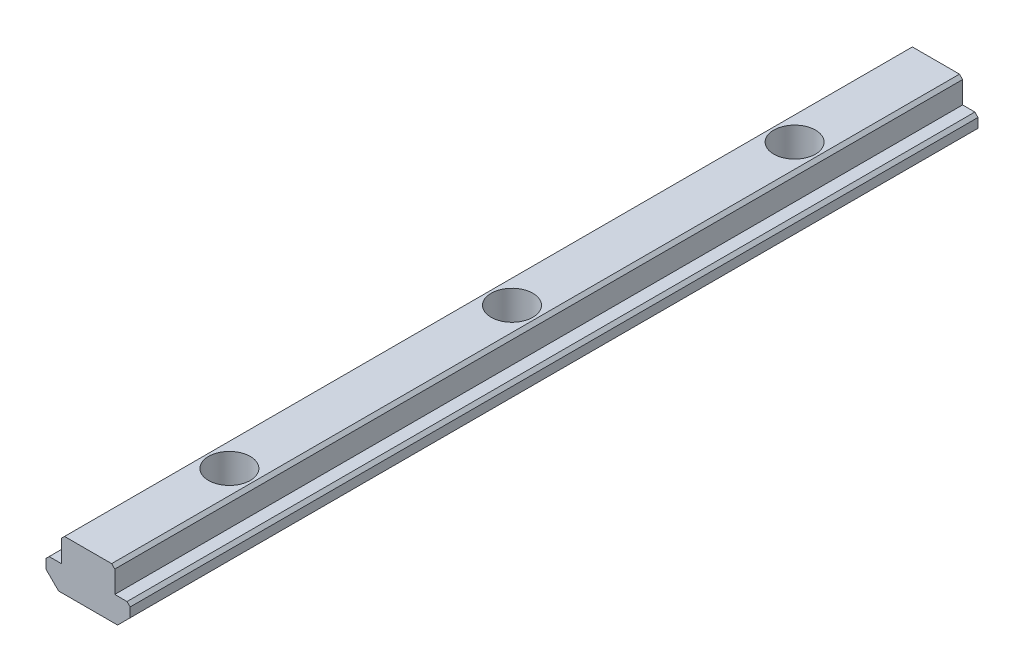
ISO-10303-21;
HEADER;
FILE_DESCRIPTION(('STEP AP214'),'2;1');
FILE_NAME('part.step','',(''),(''),'','','');
FILE_SCHEMA(('AUTOMOTIVE_DESIGN { 1 0 10303 214 1 1 1 1 }'));
ENDSEC;
DATA;
#1=APPLICATION_CONTEXT('core data for automotive mechanical design processes');
#2=APPLICATION_PROTOCOL_DEFINITION('international standard','automotive_design',2000,#1);
#3=PRODUCT_CONTEXT('',#1,'mechanical');
#4=PRODUCT('Part','Part','',(#3));
#5=PRODUCT_RELATED_PRODUCT_CATEGORY('part','',(#4));
#6=PRODUCT_DEFINITION_FORMATION('','',#4);
#7=PRODUCT_DEFINITION_CONTEXT('part definition',#1,'design');
#8=PRODUCT_DEFINITION('design','',#6,#7);
#9=PRODUCT_DEFINITION_SHAPE('','',#8);
#10=(LENGTH_UNIT() NAMED_UNIT(*) SI_UNIT(.MILLI.,.METRE.));
#11=(NAMED_UNIT(*) PLANE_ANGLE_UNIT() SI_UNIT($,.RADIAN.));
#12=(NAMED_UNIT(*) SI_UNIT($,.STERADIAN.) SOLID_ANGLE_UNIT());
#13=UNCERTAINTY_MEASURE_WITH_UNIT(LENGTH_MEASURE(1.E-05),#10,'distance_accuracy_value','');
#14=(GEOMETRIC_REPRESENTATION_CONTEXT(3) GLOBAL_UNCERTAINTY_ASSIGNED_CONTEXT((#13)) GLOBAL_UNIT_ASSIGNED_CONTEXT((#10,
#11,#12)) REPRESENTATION_CONTEXT('',''));
#15=CARTESIAN_POINT('',(0.,0.,0.));
#16=DIRECTION('',(0.,0.,1.));
#17=DIRECTION('',(1.,0.,0.));
#18=AXIS2_PLACEMENT_3D('',#15,#16,#17);
#19=CARTESIAN_POINT('',(-6.7,-0.499999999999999,0.));
#20=DIRECTION('',(-0.707106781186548,0.707106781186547,0.));
#21=DIRECTION('',(-0.707106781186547,-0.707106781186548,0.));
#22=AXIS2_PLACEMENT_3D('',#19,#20,#21);
#23=PLANE('',#22);
#24=DIRECTION('',(-0.707106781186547,-0.707106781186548,0.));
#25=VECTOR('',#24,1.);
#26=CARTESIAN_POINT('',(-6.7,-0.499999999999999,0.));
#27=LINE('',#26,#25);
#28=CARTESIAN_POINT('',(-6.2,0.,0.));
#29=VERTEX_POINT('',#28);
#30=CARTESIAN_POINT('',(-6.7,-0.499999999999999,0.));
#31=VERTEX_POINT('',#30);
#32=EDGE_CURVE('E178',#29,#31,#27,.T.);
#33=ORIENTED_EDGE('',*,*,#32,.T.);
#34=DIRECTION('',(0.,0.,1.));
#35=VECTOR('',#34,1.);
#36=CARTESIAN_POINT('',(-6.7,-0.499999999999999,0.));
#37=LINE('',#36,#35);
#38=CARTESIAN_POINT('',(-6.7,-0.499999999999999,135.));
#39=VERTEX_POINT('',#38);
#40=EDGE_CURVE('E167',#39,#31,#37,.F.);
#41=ORIENTED_EDGE('',*,*,#40,.F.);
#42=DIRECTION('',(-0.707106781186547,-0.707106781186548,0.));
#43=VECTOR('',#42,1.);
#44=CARTESIAN_POINT('',(-6.7,-0.499999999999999,135.));
#45=LINE('',#44,#43);
#46=CARTESIAN_POINT('',(-6.2,0.,135.));
#47=VERTEX_POINT('',#46);
#48=EDGE_CURVE('E181',#39,#47,#45,.F.);
#49=ORIENTED_EDGE('',*,*,#48,.T.);
#50=DIRECTION('',(0.,0.,1.));
#51=VECTOR('',#50,1.);
#52=CARTESIAN_POINT('',(-6.2,0.,0.));
#53=LINE('',#52,#51);
#54=EDGE_CURVE('E162',#29,#47,#53,.T.);
#55=ORIENTED_EDGE('',*,*,#54,.F.);
#56=EDGE_LOOP('',(#33,#41,#49,#55));
#57=FACE_BOUND('',#56,.T.);
#58=ADVANCED_FACE('F15',(#57),#23,.T.);
#59=CARTESIAN_POINT('',(6.2,0.,0.));
#60=DIRECTION('',(0.707106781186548,0.707106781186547,0.));
#61=DIRECTION('',(-0.707106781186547,0.707106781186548,0.));
#62=AXIS2_PLACEMENT_3D('',#59,#60,#61);
#63=PLANE('',#62);
#64=DIRECTION('',(-0.707106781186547,0.707106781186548,0.));
#65=VECTOR('',#64,1.);
#66=CARTESIAN_POINT('',(6.2,0.,0.));
#67=LINE('',#66,#65);
#68=CARTESIAN_POINT('',(6.7,-0.500000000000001,0.));
#69=VERTEX_POINT('',#68);
#70=CARTESIAN_POINT('',(6.2,0.,0.));
#71=VERTEX_POINT('',#70);
#72=EDGE_CURVE('E174',#69,#71,#67,.T.);
#73=ORIENTED_EDGE('',*,*,#72,.T.);
#74=DIRECTION('',(0.,0.,1.));
#75=VECTOR('',#74,1.);
#76=CARTESIAN_POINT('',(6.2,0.,0.));
#77=LINE('',#76,#75);
#78=CARTESIAN_POINT('',(6.2,0.,135.));
#79=VERTEX_POINT('',#78);
#80=EDGE_CURVE('E159',#79,#71,#77,.F.);
#81=ORIENTED_EDGE('',*,*,#80,.F.);
#82=DIRECTION('',(-0.707106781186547,0.707106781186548,0.));
#83=VECTOR('',#82,1.);
#84=CARTESIAN_POINT('',(6.2,0.,135.));
#85=LINE('',#84,#83);
#86=CARTESIAN_POINT('',(6.7,-0.500000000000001,135.));
#87=VERTEX_POINT('',#86);
#88=EDGE_CURVE('E176',#79,#87,#85,.F.);
#89=ORIENTED_EDGE('',*,*,#88,.T.);
#90=DIRECTION('',(0.,0.,-1.));
#91=VECTOR('',#90,1.);
#92=CARTESIAN_POINT('',(6.7,-0.500000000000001,0.));
#93=LINE('',#92,#91);
#94=EDGE_CURVE('E150',#69,#87,#93,.F.);
#95=ORIENTED_EDGE('',*,*,#94,.F.);
#96=EDGE_LOOP('',(#73,#81,#89,#95));
#97=FACE_BOUND('',#96,.T.);
#98=ADVANCED_FACE('F289',(#97),#63,.T.);
#99=CARTESIAN_POINT('',(3.75,4.,0.));
#100=DIRECTION('',(0.707106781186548,0.707106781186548,0.));
#101=DIRECTION('',(-0.707106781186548,0.707106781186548,0.));
#102=AXIS2_PLACEMENT_3D('',#99,#100,#101);
#103=PLANE('',#102);
#104=DIRECTION('',(-0.707106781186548,0.707106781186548,0.));
#105=VECTOR('',#104,1.);
#106=CARTESIAN_POINT('',(3.75,4.,0.));
#107=LINE('',#106,#105);
#108=CARTESIAN_POINT('',(4.25,3.5,0.));
#109=VERTEX_POINT('',#108);
#110=CARTESIAN_POINT('',(3.75,4.,0.));
#111=VERTEX_POINT('',#110);
#112=EDGE_CURVE('E126',#109,#111,#107,.T.);
#113=ORIENTED_EDGE('',*,*,#112,.T.);
#114=DIRECTION('',(0.,0.,1.));
#115=VECTOR('',#114,1.);
#116=CARTESIAN_POINT('',(3.75,4.,0.));
#117=LINE('',#116,#115);
#118=CARTESIAN_POINT('',(3.75,4.,135.));
#119=VERTEX_POINT('',#118);
#120=EDGE_CURVE('E144',#119,#111,#117,.F.);
#121=ORIENTED_EDGE('',*,*,#120,.F.);
#122=DIRECTION('',(-0.707106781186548,0.707106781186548,0.));
#123=VECTOR('',#122,1.);
#124=CARTESIAN_POINT('',(3.75,4.,135.));
#125=LINE('',#124,#123);
#126=CARTESIAN_POINT('',(4.25,3.5,135.));
#127=VERTEX_POINT('',#126);
#128=EDGE_CURVE('E172',#119,#127,#125,.F.);
#129=ORIENTED_EDGE('',*,*,#128,.T.);
#130=DIRECTION('',(0.,0.,-1.));
#131=VECTOR('',#130,1.);
#132=CARTESIAN_POINT('',(4.25,3.5,0.));
#133=LINE('',#132,#131);
#134=EDGE_CURVE('E135',#109,#127,#133,.F.);
#135=ORIENTED_EDGE('',*,*,#134,.F.);
#136=EDGE_LOOP('',(#113,#121,#129,#135));
#137=FACE_BOUND('',#136,.T.);
#138=ADVANCED_FACE('F277',(#137),#103,.T.);
#139=CARTESIAN_POINT('',(-4.24999999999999,3.5,0.));
#140=DIRECTION('',(-0.707106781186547,0.707106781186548,0.));
#141=DIRECTION('',(-0.707106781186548,-0.707106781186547,0.));
#142=AXIS2_PLACEMENT_3D('',#139,#140,#141);
#143=PLANE('',#142);
#144=DIRECTION('',(-0.707106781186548,-0.707106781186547,0.));
#145=VECTOR('',#144,1.);
#146=CARTESIAN_POINT('',(-4.24999999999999,3.5,0.));
#147=LINE('',#146,#145);
#148=CARTESIAN_POINT('',(-3.74999999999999,4.,0.));
#149=VERTEX_POINT('',#148);
#150=CARTESIAN_POINT('',(-4.24999999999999,3.5,0.));
#151=VERTEX_POINT('',#150);
#152=EDGE_CURVE('E125',#149,#151,#147,.T.);
#153=ORIENTED_EDGE('',*,*,#152,.T.);
#154=DIRECTION('',(0.,0.,1.));
#155=VECTOR('',#154,1.);
#156=CARTESIAN_POINT('',(-4.24999999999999,3.5,0.));
#157=LINE('',#156,#155);
#158=CARTESIAN_POINT('',(-4.24999999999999,3.5,135.));
#159=VERTEX_POINT('',#158);
#160=EDGE_CURVE('E129',#159,#151,#157,.F.);
#161=ORIENTED_EDGE('',*,*,#160,.F.);
#162=DIRECTION('',(-0.707106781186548,-0.707106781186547,0.));
#163=VECTOR('',#162,1.);
#164=CARTESIAN_POINT('',(-4.24999999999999,3.5,135.));
#165=LINE('',#164,#163);
#166=CARTESIAN_POINT('',(-3.74999999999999,4.,135.));
#167=VERTEX_POINT('',#166);
#168=EDGE_CURVE('E114',#159,#167,#165,.F.);
#169=ORIENTED_EDGE('',*,*,#168,.T.);
#170=DIRECTION('',(0.,0.,1.));
#171=VECTOR('',#170,1.);
#172=CARTESIAN_POINT('',(-3.74999999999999,4.,0.));
#173=LINE('',#172,#171);
#174=EDGE_CURVE('E140',#149,#167,#173,.T.);
#175=ORIENTED_EDGE('',*,*,#174,.F.);
#176=EDGE_LOOP('',(#153,#161,#169,#175));
#177=FACE_BOUND('',#176,.T.);
#178=ADVANCED_FACE('F130',(#177),#143,.T.);
#179=CARTESIAN_POINT('',(-6.7,-2.,0.));
#180=DIRECTION('',(-1.,0.,0.));
#181=DIRECTION('',(0.,0.,1.));
#182=AXIS2_PLACEMENT_3D('',#179,#180,#181);
#183=PLANE('',#182);
#184=DIRECTION('',(0.,1.,0.));
#185=VECTOR('',#184,1.);
#186=CARTESIAN_POINT('',(-6.7,-2.,0.));
#187=LINE('',#186,#185);
#188=CARTESIAN_POINT('',(-6.7,-2.,0.));
#189=VERTEX_POINT('',#188);
#190=EDGE_CURVE('E165',#31,#189,#187,.F.);
#191=ORIENTED_EDGE('',*,*,#190,.T.);
#192=DIRECTION('',(0.,0.,1.));
#193=VECTOR('',#192,1.);
#194=CARTESIAN_POINT('',(-6.7,-2.,0.));
#195=LINE('',#194,#193);
#196=CARTESIAN_POINT('',(-6.7,-2.,135.));
#197=VERTEX_POINT('',#196);
#198=EDGE_CURVE('E229',#197,#189,#195,.F.);
#199=ORIENTED_EDGE('',*,*,#198,.F.);
#200=DIRECTION('',(0.,1.,0.));
#201=VECTOR('',#200,1.);
#202=CARTESIAN_POINT('',(-6.7,-0.2830784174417,135.));
#203=LINE('',#202,#201);
#204=EDGE_CURVE('E142',#39,#197,#203,.F.);
#205=ORIENTED_EDGE('',*,*,#204,.F.);
#206=ORIENTED_EDGE('',*,*,#40,.T.);
#207=EDGE_LOOP('',(#191,#199,#205,#206));
#208=FACE_BOUND('',#207,.T.);
#209=ADVANCED_FACE('F249',(#208),#183,.T.);
#210=CARTESIAN_POINT('',(-6.2,0.,0.));
#211=DIRECTION('',(0.,1.,0.));
#212=DIRECTION('',(0.,0.,1.));
#213=AXIS2_PLACEMENT_3D('',#210,#211,#212);
#214=PLANE('',#213);
#215=DIRECTION('',(1.,0.,0.));
#216=VECTOR('',#215,1.);
#217=CARTESIAN_POINT('',(0.,0.,0.));
#218=LINE('',#217,#216);
#219=CARTESIAN_POINT('',(-4.24999999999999,0.,0.));
#220=VERTEX_POINT('',#219);
#221=EDGE_CURVE('E226',#220,#29,#218,.F.);
#222=ORIENTED_EDGE('',*,*,#221,.T.);
#223=ORIENTED_EDGE('',*,*,#54,.T.);
#224=DIRECTION('',(1.,0.,0.));
#225=VECTOR('',#224,1.);
#226=CARTESIAN_POINT('',(0.,0.,135.));
#227=LINE('',#226,#225);
#228=CARTESIAN_POINT('',(-4.24999999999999,0.,135.));
#229=VERTEX_POINT('',#228);
#230=EDGE_CURVE('E139',#229,#47,#227,.F.);
#231=ORIENTED_EDGE('',*,*,#230,.F.);
#232=DIRECTION('',(0.,0.,1.));
#233=VECTOR('',#232,1.);
#234=CARTESIAN_POINT('',(-4.24999999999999,0.,0.));
#235=LINE('',#234,#233);
#236=EDGE_CURVE('E134',#220,#229,#235,.T.);
#237=ORIENTED_EDGE('',*,*,#236,.F.);
#238=EDGE_LOOP('',(#222,#223,#231,#237));
#239=FACE_BOUND('',#238,.T.);
#240=ADVANCED_FACE('F271',(#239),#214,.T.);
#241=CARTESIAN_POINT('',(4.25,0.,0.));
#242=DIRECTION('',(0.,1.,0.));
#243=DIRECTION('',(0.,0.,1.));
#244=AXIS2_PLACEMENT_3D('',#241,#242,#243);
#245=PLANE('',#244);
#246=DIRECTION('',(1.,0.,0.));
#247=VECTOR('',#246,1.);
#248=CARTESIAN_POINT('',(0.,0.,0.));
#249=LINE('',#248,#247);
#250=CARTESIAN_POINT('',(4.25,0.,0.));
#251=VERTEX_POINT('',#250);
#252=EDGE_CURVE('E219',#71,#251,#249,.F.);
#253=ORIENTED_EDGE('',*,*,#252,.T.);
#254=DIRECTION('',(0.,0.,-1.));
#255=VECTOR('',#254,1.);
#256=CARTESIAN_POINT('',(4.25,0.,0.));
#257=LINE('',#256,#255);
#258=CARTESIAN_POINT('',(4.25,0.,135.));
#259=VERTEX_POINT('',#258);
#260=EDGE_CURVE('E156',#259,#251,#257,.T.);
#261=ORIENTED_EDGE('',*,*,#260,.F.);
#262=DIRECTION('',(1.,0.,0.));
#263=VECTOR('',#262,1.);
#264=CARTESIAN_POINT('',(0.,0.,135.));
#265=LINE('',#264,#263);
#266=EDGE_CURVE('E239',#79,#259,#265,.F.);
#267=ORIENTED_EDGE('',*,*,#266,.F.);
#268=ORIENTED_EDGE('',*,*,#80,.T.);
#269=EDGE_LOOP('',(#253,#261,#267,#268));
#270=FACE_BOUND('',#269,.T.);
#271=ADVANCED_FACE('F286',(#270),#245,.T.);
#272=CARTESIAN_POINT('',(4.25,3.5,0.));
#273=DIRECTION('',(1.,0.,0.));
#274=DIRECTION('',(0.,0.,-1.));
#275=AXIS2_PLACEMENT_3D('',#272,#273,#274);
#276=PLANE('',#275);
#277=DIRECTION('',(0.,1.,0.));
#278=VECTOR('',#277,1.);
#279=CARTESIAN_POINT('',(4.25,-0.2830784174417,0.));
#280=LINE('',#279,#278);
#281=EDGE_CURVE('E216',#251,#109,#280,.T.);
#282=ORIENTED_EDGE('',*,*,#281,.T.);
#283=ORIENTED_EDGE('',*,*,#134,.T.);
#284=DIRECTION('',(0.,1.,0.));
#285=VECTOR('',#284,1.);
#286=CARTESIAN_POINT('',(4.25,-0.2830784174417,135.));
#287=LINE('',#286,#285);
#288=EDGE_CURVE('E236',#259,#127,#287,.T.);
#289=ORIENTED_EDGE('',*,*,#288,.F.);
#290=ORIENTED_EDGE('',*,*,#260,.T.);
#291=EDGE_LOOP('',(#282,#283,#289,#290));
#292=FACE_BOUND('',#291,.T.);
#293=ADVANCED_FACE('F282',(#292),#276,.T.);
#294=CARTESIAN_POINT('',(-4.24999999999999,0.,0.));
#295=DIRECTION('',(-1.,0.,0.));
#296=DIRECTION('',(0.,0.,1.));
#297=AXIS2_PLACEMENT_3D('',#294,#295,#296);
#298=PLANE('',#297);
#299=DIRECTION('',(0.,1.,0.));
#300=VECTOR('',#299,1.);
#301=CARTESIAN_POINT('',(-4.24999999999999,-0.2830784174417,0.));
#302=LINE('',#301,#300);
#303=EDGE_CURVE('E211',#151,#220,#302,.F.);
#304=ORIENTED_EDGE('',*,*,#303,.T.);
#305=ORIENTED_EDGE('',*,*,#236,.T.);
#306=DIRECTION('',(0.,1.,0.));
#307=VECTOR('',#306,1.);
#308=CARTESIAN_POINT('',(-4.24999999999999,-0.2830784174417,135.));
#309=LINE('',#308,#307);
#310=EDGE_CURVE('E119',#159,#229,#309,.F.);
#311=ORIENTED_EDGE('',*,*,#310,.F.);
#312=ORIENTED_EDGE('',*,*,#160,.T.);
#313=EDGE_LOOP('',(#304,#305,#311,#312));
#314=FACE_BOUND('',#313,.T.);
#315=ADVANCED_FACE('F137',(#314),#298,.T.);
#316=CARTESIAN_POINT('',(6.7,-0.500000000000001,0.));
#317=DIRECTION('',(1.,0.,0.));
#318=DIRECTION('',(0.,0.,-1.));
#319=AXIS2_PLACEMENT_3D('',#316,#317,#318);
#320=PLANE('',#319);
#321=DIRECTION('',(0.,1.,0.));
#322=VECTOR('',#321,1.);
#323=CARTESIAN_POINT('',(6.7,-0.2830784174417,0.));
#324=LINE('',#323,#322);
#325=CARTESIAN_POINT('',(6.7,-2.,0.));
#326=VERTEX_POINT('',#325);
#327=EDGE_CURVE('E221',#326,#69,#324,.T.);
#328=ORIENTED_EDGE('',*,*,#327,.T.);
#329=ORIENTED_EDGE('',*,*,#94,.T.);
#330=DIRECTION('',(0.,1.,0.));
#331=VECTOR('',#330,1.);
#332=CARTESIAN_POINT('',(6.7,-0.2830784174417,135.));
#333=LINE('',#332,#331);
#334=CARTESIAN_POINT('',(6.7,-2.,135.));
#335=VERTEX_POINT('',#334);
#336=EDGE_CURVE('E242',#335,#87,#333,.T.);
#337=ORIENTED_EDGE('',*,*,#336,.F.);
#338=DIRECTION('',(0.,0.,1.));
#339=VECTOR('',#338,1.);
#340=CARTESIAN_POINT('',(6.7,-2.,0.));
#341=LINE('',#340,#339);
#342=EDGE_CURVE('E197',#326,#335,#341,.T.);
#343=ORIENTED_EDGE('',*,*,#342,.F.);
#344=EDGE_LOOP('',(#328,#329,#337,#343));
#345=FACE_BOUND('',#344,.T.);
#346=ADVANCED_FACE('F292',(#345),#320,.T.);
#347=CARTESIAN_POINT('',(-3.74999999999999,4.,0.));
#348=DIRECTION('',(0.,1.,0.));
#349=DIRECTION('',(0.,0.,1.));
#350=AXIS2_PLACEMENT_3D('',#347,#348,#349);
#351=PLANE('',#350);
#352=CARTESIAN_POINT('',(0.,4.,22.5));
#353=DIRECTION('',(0.,-1.,0.));
#354=DIRECTION('',(0.,0.,-1.));
#355=AXIS2_PLACEMENT_3D('',#352,#353,#354);
#356=CIRCLE('',#355,3.3235);
#357=CARTESIAN_POINT('',(0.,4.,19.1765));
#358=VERTEX_POINT('',#357);
#359=EDGE_CURVE('E189',#358,#358,#356,.T.);
#360=ORIENTED_EDGE('',*,*,#359,.T.);
#361=EDGE_LOOP('',(#360));
#362=FACE_BOUND('',#361,.T.);
#363=CARTESIAN_POINT('',(0.,4.,112.5));
#364=DIRECTION('',(0.,-1.,0.));
#365=DIRECTION('',(0.,0.,-1.));
#366=AXIS2_PLACEMENT_3D('',#363,#364,#365);
#367=CIRCLE('',#366,3.3235);
#368=CARTESIAN_POINT('',(0.,4.,109.1765));
#369=VERTEX_POINT('',#368);
#370=EDGE_CURVE('E192',#369,#369,#367,.T.);
#371=ORIENTED_EDGE('',*,*,#370,.T.);
#372=EDGE_LOOP('',(#371));
#373=FACE_BOUND('',#372,.T.);
#374=CARTESIAN_POINT('',(0.,4.,67.5));
#375=DIRECTION('',(0.,-1.,0.));
#376=DIRECTION('',(0.,0.,-1.));
#377=AXIS2_PLACEMENT_3D('',#374,#375,#376);
#378=CIRCLE('',#377,3.3235);
#379=CARTESIAN_POINT('',(0.,4.,64.1765));
#380=VERTEX_POINT('',#379);
#381=EDGE_CURVE('E19',#380,#380,#378,.T.);
#382=ORIENTED_EDGE('',*,*,#381,.T.);
#383=EDGE_LOOP('',(#382));
#384=FACE_BOUND('',#383,.T.);
#385=DIRECTION('',(1.,0.,0.));
#386=VECTOR('',#385,1.);
#387=CARTESIAN_POINT('',(0.,4.,0.));
#388=LINE('',#387,#386);
#389=EDGE_CURVE('E213',#111,#149,#388,.F.);
#390=ORIENTED_EDGE('',*,*,#389,.T.);
#391=ORIENTED_EDGE('',*,*,#174,.T.);
#392=DIRECTION('',(1.,0.,0.));
#393=VECTOR('',#392,1.);
#394=CARTESIAN_POINT('',(0.,4.,135.));
#395=LINE('',#394,#393);
#396=EDGE_CURVE('E121',#119,#167,#395,.F.);
#397=ORIENTED_EDGE('',*,*,#396,.F.);
#398=ORIENTED_EDGE('',*,*,#120,.T.);
#399=EDGE_LOOP('',(#390,#391,#397,#398));
#400=FACE_BOUND('',#399,.T.);
#401=ADVANCED_FACE('F274',(#362,#373,#384,#400),#351,.T.);
#402=CARTESIAN_POINT('',(0.,-0.2830784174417,135.));
#403=DIRECTION('',(0.,0.,1.));
#404=DIRECTION('',(1.,0.,0.));
#405=AXIS2_PLACEMENT_3D('',#402,#403,#404);
#406=PLANE('',#405);
#407=ORIENTED_EDGE('',*,*,#128,.F.);
#408=ORIENTED_EDGE('',*,*,#396,.T.);
#409=ORIENTED_EDGE('',*,*,#168,.F.);
#410=ORIENTED_EDGE('',*,*,#310,.T.);
#411=ORIENTED_EDGE('',*,*,#230,.T.);
#412=ORIENTED_EDGE('',*,*,#48,.F.);
#413=ORIENTED_EDGE('',*,*,#204,.T.);
#414=DIRECTION('',(0.707106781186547,-0.707106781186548,0.));
#415=VECTOR('',#414,1.);
#416=CARTESIAN_POINT('',(-4.7,-4.,135.));
#417=LINE('',#416,#415);
#418=CARTESIAN_POINT('',(-4.7,-4.,135.));
#419=VERTEX_POINT('',#418);
#420=EDGE_CURVE('E232',#419,#197,#417,.F.);
#421=ORIENTED_EDGE('',*,*,#420,.F.);
#422=DIRECTION('',(1.,0.,0.));
#423=VECTOR('',#422,1.);
#424=CARTESIAN_POINT('',(4.7,-4.,135.));
#425=LINE('',#424,#423);
#426=CARTESIAN_POINT('',(4.7,-4.,135.));
#427=VERTEX_POINT('',#426);
#428=EDGE_CURVE('E191',#427,#419,#425,.F.);
#429=ORIENTED_EDGE('',*,*,#428,.F.);
#430=DIRECTION('',(0.707106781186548,0.707106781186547,0.));
#431=VECTOR('',#430,1.);
#432=CARTESIAN_POINT('',(6.7,-2.,135.));
#433=LINE('',#432,#431);
#434=EDGE_CURVE('E205',#335,#427,#433,.F.);
#435=ORIENTED_EDGE('',*,*,#434,.F.);
#436=ORIENTED_EDGE('',*,*,#336,.T.);
#437=ORIENTED_EDGE('',*,*,#88,.F.);
#438=ORIENTED_EDGE('',*,*,#266,.T.);
#439=ORIENTED_EDGE('',*,*,#288,.T.);
#440=EDGE_LOOP('',(#407,#408,#409,#410,#411,#412,#413,#421,#429,#435,#436,#437,#438,#439));
#441=FACE_BOUND('',#440,.T.);
#442=ADVANCED_FACE('F116',(#441),#406,.T.);
#443=CARTESIAN_POINT('',(-4.7,-4.,0.));
#444=DIRECTION('',(-0.707106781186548,-0.707106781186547,0.));
#445=DIRECTION('',(0.707106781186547,-0.707106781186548,0.));
#446=AXIS2_PLACEMENT_3D('',#443,#444,#445);
#447=PLANE('',#446);
#448=DIRECTION('',(0.707106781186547,-0.707106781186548,0.));
#449=VECTOR('',#448,1.);
#450=CARTESIAN_POINT('',(-6.7,-2.,0.));
#451=LINE('',#450,#449);
#452=CARTESIAN_POINT('',(-4.7,-4.,0.));
#453=VERTEX_POINT('',#452);
#454=EDGE_CURVE('E224',#189,#453,#451,.T.);
#455=ORIENTED_EDGE('',*,*,#454,.T.);
#456=DIRECTION('',(0.,0.,-1.));
#457=VECTOR('',#456,1.);
#458=CARTESIAN_POINT('',(-4.7,-4.,0.));
#459=LINE('',#458,#457);
#460=EDGE_CURVE('E255',#419,#453,#459,.T.);
#461=ORIENTED_EDGE('',*,*,#460,.F.);
#462=ORIENTED_EDGE('',*,*,#420,.T.);
#463=ORIENTED_EDGE('',*,*,#198,.T.);
#464=EDGE_LOOP('',(#455,#461,#462,#463));
#465=FACE_BOUND('',#464,.T.);
#466=ADVANCED_FACE('F253',(#465),#447,.T.);
#467=CARTESIAN_POINT('',(0.,-0.2830784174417,0.));
#468=DIRECTION('',(0.,0.,1.));
#469=DIRECTION('',(1.,0.,0.));
#470=AXIS2_PLACEMENT_3D('',#467,#468,#469);
#471=PLANE('',#470);
#472=ORIENTED_EDGE('',*,*,#152,.F.);
#473=ORIENTED_EDGE('',*,*,#389,.F.);
#474=ORIENTED_EDGE('',*,*,#112,.F.);
#475=ORIENTED_EDGE('',*,*,#281,.F.);
#476=ORIENTED_EDGE('',*,*,#252,.F.);
#477=ORIENTED_EDGE('',*,*,#72,.F.);
#478=ORIENTED_EDGE('',*,*,#327,.F.);
#479=DIRECTION('',(0.707106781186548,0.707106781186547,0.));
#480=VECTOR('',#479,1.);
#481=CARTESIAN_POINT('',(6.7,-2.,0.));
#482=LINE('',#481,#480);
#483=CARTESIAN_POINT('',(4.7,-4.,0.));
#484=VERTEX_POINT('',#483);
#485=EDGE_CURVE('E34',#484,#326,#482,.T.);
#486=ORIENTED_EDGE('',*,*,#485,.F.);
#487=DIRECTION('',(1.,0.,0.));
#488=VECTOR('',#487,1.);
#489=CARTESIAN_POINT('',(4.7,-4.,0.));
#490=LINE('',#489,#488);
#491=EDGE_CURVE('E259',#453,#484,#490,.T.);
#492=ORIENTED_EDGE('',*,*,#491,.F.);
#493=ORIENTED_EDGE('',*,*,#454,.F.);
#494=ORIENTED_EDGE('',*,*,#190,.F.);
#495=ORIENTED_EDGE('',*,*,#32,.F.);
#496=ORIENTED_EDGE('',*,*,#221,.F.);
#497=ORIENTED_EDGE('',*,*,#303,.F.);
#498=EDGE_LOOP('',(#472,#473,#474,#475,#476,#477,#478,#486,#492,#493,#494,#495,#496,#497));
#499=FACE_BOUND('',#498,.T.);
#500=ADVANCED_FACE('F266',(#499),#471,.F.);
#501=CARTESIAN_POINT('',(6.7,-2.,0.));
#502=DIRECTION('',(0.707106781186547,-0.707106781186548,0.));
#503=DIRECTION('',(0.707106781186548,0.707106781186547,0.));
#504=AXIS2_PLACEMENT_3D('',#501,#502,#503);
#505=PLANE('',#504);
#506=ORIENTED_EDGE('',*,*,#485,.T.);
#507=ORIENTED_EDGE('',*,*,#342,.T.);
#508=ORIENTED_EDGE('',*,*,#434,.T.);
#509=DIRECTION('',(0.,0.,-1.));
#510=VECTOR('',#509,1.);
#511=CARTESIAN_POINT('',(4.7,-4.,0.));
#512=LINE('',#511,#510);
#513=EDGE_CURVE('E188',#484,#427,#512,.F.);
#514=ORIENTED_EDGE('',*,*,#513,.F.);
#515=EDGE_LOOP('',(#506,#507,#508,#514));
#516=FACE_BOUND('',#515,.T.);
#517=ADVANCED_FACE('F263',(#516),#505,.T.);
#518=CARTESIAN_POINT('',(0.,4.,67.5));
#519=DIRECTION('',(0.,-1.,0.));
#520=DIRECTION('',(0.,0.,-1.));
#521=AXIS2_PLACEMENT_3D('',#518,#519,#520);
#522=CYLINDRICAL_SURFACE('',#521,3.3235);
#523=ORIENTED_EDGE('',*,*,#381,.F.);
#524=EDGE_LOOP('',(#523));
#525=FACE_BOUND('',#524,.T.);
#526=CARTESIAN_POINT('',(0.,-4.,67.5));
#527=DIRECTION('',(0.,-1.,0.));
#528=DIRECTION('',(0.,0.,-1.));
#529=AXIS2_PLACEMENT_3D('',#526,#527,#528);
#530=CIRCLE('',#529,3.3235);
#531=CARTESIAN_POINT('',(0.,-4.,64.1765));
#532=VERTEX_POINT('',#531);
#533=EDGE_CURVE('E185',#532,#532,#530,.F.);
#534=ORIENTED_EDGE('',*,*,#533,.F.);
#535=EDGE_LOOP('',(#534));
#536=FACE_BOUND('',#535,.T.);
#537=ADVANCED_FACE('F315',(#525,#536),#522,.F.);
#538=CARTESIAN_POINT('',(0.,4.,112.5));
#539=DIRECTION('',(0.,-1.,0.));
#540=DIRECTION('',(0.,0.,-1.));
#541=AXIS2_PLACEMENT_3D('',#538,#539,#540);
#542=CYLINDRICAL_SURFACE('',#541,3.3235);
#543=ORIENTED_EDGE('',*,*,#370,.F.);
#544=EDGE_LOOP('',(#543));
#545=FACE_BOUND('',#544,.T.);
#546=CARTESIAN_POINT('',(0.,-4.,112.5));
#547=DIRECTION('',(0.,-1.,0.));
#548=DIRECTION('',(0.,0.,-1.));
#549=AXIS2_PLACEMENT_3D('',#546,#547,#548);
#550=CIRCLE('',#549,3.3235);
#551=CARTESIAN_POINT('',(0.,-4.,109.1765));
#552=VERTEX_POINT('',#551);
#553=EDGE_CURVE('E25',#552,#552,#550,.F.);
#554=ORIENTED_EDGE('',*,*,#553,.F.);
#555=EDGE_LOOP('',(#554));
#556=FACE_BOUND('',#555,.T.);
#557=ADVANCED_FACE('F309',(#545,#556),#542,.F.);
#558=CARTESIAN_POINT('',(0.,4.,22.5));
#559=DIRECTION('',(0.,-1.,0.));
#560=DIRECTION('',(0.,0.,-1.));
#561=AXIS2_PLACEMENT_3D('',#558,#559,#560);
#562=CYLINDRICAL_SURFACE('',#561,3.3235);
#563=ORIENTED_EDGE('',*,*,#359,.F.);
#564=EDGE_LOOP('',(#563));
#565=FACE_BOUND('',#564,.T.);
#566=CARTESIAN_POINT('',(0.,-4.,22.5));
#567=DIRECTION('',(0.,-1.,0.));
#568=DIRECTION('',(0.,0.,-1.));
#569=AXIS2_PLACEMENT_3D('',#566,#567,#568);
#570=CIRCLE('',#569,3.3235);
#571=CARTESIAN_POINT('',(0.,-4.,19.1765));
#572=VERTEX_POINT('',#571);
#573=EDGE_CURVE('E10',#572,#572,#570,.F.);
#574=ORIENTED_EDGE('',*,*,#573,.F.);
#575=EDGE_LOOP('',(#574));
#576=FACE_BOUND('',#575,.T.);
#577=ADVANCED_FACE('F17',(#565,#576),#562,.F.);
#578=CARTESIAN_POINT('',(4.7,-4.,0.));
#579=DIRECTION('',(0.,-1.,0.));
#580=DIRECTION('',(0.,0.,-1.));
#581=AXIS2_PLACEMENT_3D('',#578,#579,#580);
#582=PLANE('',#581);
#583=ORIENTED_EDGE('',*,*,#573,.T.);
#584=EDGE_LOOP('',(#583));
#585=FACE_BOUND('',#584,.T.);
#586=ORIENTED_EDGE('',*,*,#553,.T.);
#587=EDGE_LOOP('',(#586));
#588=FACE_BOUND('',#587,.T.);
#589=ORIENTED_EDGE('',*,*,#533,.T.);
#590=EDGE_LOOP('',(#589));
#591=FACE_BOUND('',#590,.T.);
#592=ORIENTED_EDGE('',*,*,#491,.T.);
#593=ORIENTED_EDGE('',*,*,#513,.T.);
#594=ORIENTED_EDGE('',*,*,#428,.T.);
#595=ORIENTED_EDGE('',*,*,#460,.T.);
#596=EDGE_LOOP('',(#592,#593,#594,#595));
#597=FACE_BOUND('',#596,.T.);
#598=ADVANCED_FACE('F261',(#585,#588,#591,#597),#582,.T.);
#599=CLOSED_SHELL('',(#58,#98,#138,#178,#209,#240,#271,#293,#315,#346,#401,#442,#466,#500,#517,
#537,#557,#577,#598));
#600=MANIFOLD_SOLID_BREP('B1',#599);
#601=ADVANCED_BREP_SHAPE_REPRESENTATION('',(#18,#600),#14);
#602=SHAPE_DEFINITION_REPRESENTATION(#9,#601);
ENDSEC;
END-ISO-10303-21;
